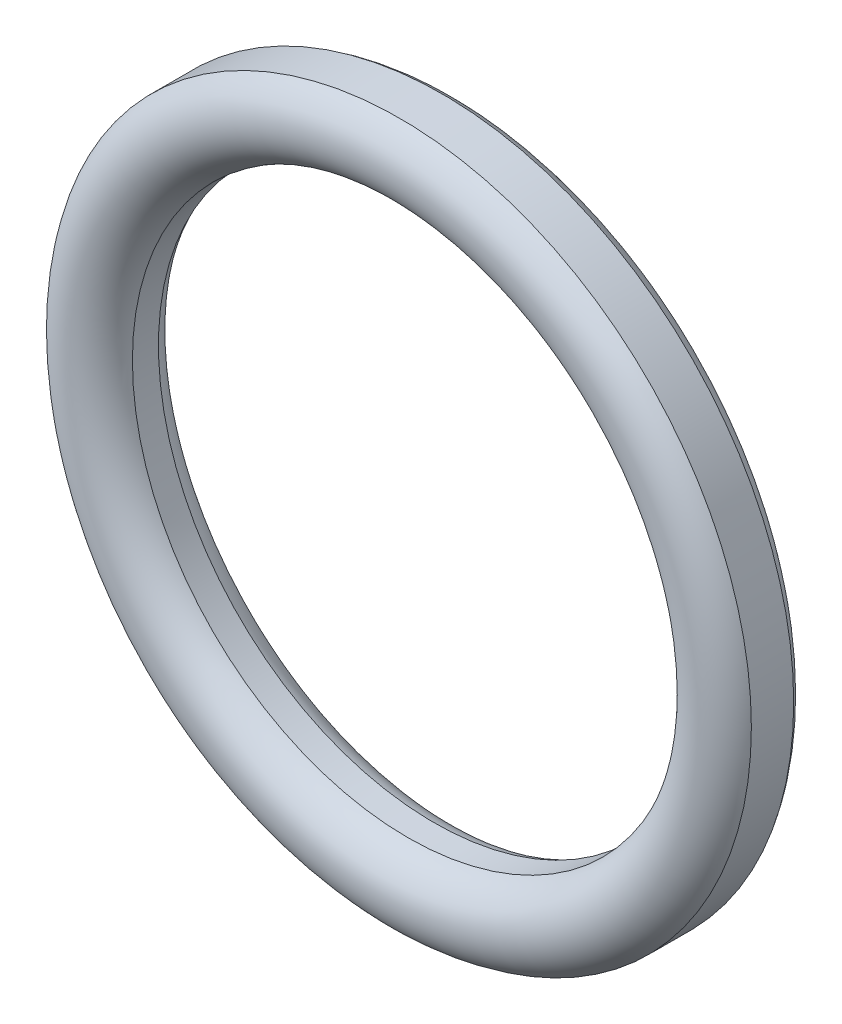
ISO-10303-21;
HEADER;
FILE_DESCRIPTION(('STEP AP214'),'2;1');
FILE_NAME('part.step','',(''),(''),'','','');
FILE_SCHEMA(('AUTOMOTIVE_DESIGN { 1 0 10303 214 1 1 1 1 }'));
ENDSEC;
DATA;
#1=APPLICATION_CONTEXT('core data for automotive mechanical design processes');
#2=APPLICATION_PROTOCOL_DEFINITION('international standard','automotive_design',2000,#1);
#3=PRODUCT_CONTEXT('',#1,'mechanical');
#4=PRODUCT('Part','Part','',(#3));
#5=PRODUCT_RELATED_PRODUCT_CATEGORY('part','',(#4));
#6=PRODUCT_DEFINITION_FORMATION('','',#4);
#7=PRODUCT_DEFINITION_CONTEXT('part definition',#1,'design');
#8=PRODUCT_DEFINITION('design','',#6,#7);
#9=PRODUCT_DEFINITION_SHAPE('','',#8);
#10=(LENGTH_UNIT() NAMED_UNIT(*) SI_UNIT(.MILLI.,.METRE.));
#11=(NAMED_UNIT(*) PLANE_ANGLE_UNIT() SI_UNIT($,.RADIAN.));
#12=(NAMED_UNIT(*) SI_UNIT($,.STERADIAN.) SOLID_ANGLE_UNIT());
#13=UNCERTAINTY_MEASURE_WITH_UNIT(LENGTH_MEASURE(1.E-05),#10,'distance_accuracy_value','');
#14=(GEOMETRIC_REPRESENTATION_CONTEXT(3) GLOBAL_UNCERTAINTY_ASSIGNED_CONTEXT((#13)) GLOBAL_UNIT_ASSIGNED_CONTEXT((#10,
#11,#12)) REPRESENTATION_CONTEXT('',''));
#15=CARTESIAN_POINT('',(0.,0.,0.));
#16=DIRECTION('',(0.,0.,1.));
#17=DIRECTION('',(1.,0.,0.));
#18=AXIS2_PLACEMENT_3D('',#15,#16,#17);
#19=CARTESIAN_POINT('',(0.,0.,0.));
#20=DIRECTION('',(0.,0.,-1.));
#21=DIRECTION('',(-1.,0.,0.));
#22=AXIS2_PLACEMENT_3D('',#19,#20,#21);
#23=TOROIDAL_SURFACE('',#22,9.87,1.31);
#24=CARTESIAN_POINT('',(0.,0.,-0.407523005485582));
#25=DIRECTION('',(0.,0.,1.));
#26=DIRECTION('',(1.,0.,0.));
#27=AXIS2_PLACEMENT_3D('',#24,#25,#26);
#28=CIRCLE('',#27,8.625);
#29=CARTESIAN_POINT('',(8.625,0.,-0.407523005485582));
#30=VERTEX_POINT('',#29);
#31=EDGE_CURVE('E11',#30,#30,#28,.F.);
#32=ORIENTED_EDGE('',*,*,#31,.F.);
#33=EDGE_LOOP('',(#32));
#34=FACE_BOUND('',#33,.T.);
#35=CARTESIAN_POINT('',(0.,0.,-0.662721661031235));
#36=DIRECTION('',(0.,0.,1.));
#37=DIRECTION('',(1.,0.,0.));
#38=AXIS2_PLACEMENT_3D('',#35,#36,#37);
#39=CIRCLE('',#38,11.);
#40=CARTESIAN_POINT('',(11.,0.,-0.662721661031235));
#41=VERTEX_POINT('',#40);
#42=EDGE_CURVE('E36',#41,#41,#39,.F.);
#43=ORIENTED_EDGE('',*,*,#42,.T.);
#44=EDGE_LOOP('',(#43));
#45=FACE_BOUND('',#44,.T.);
#46=ADVANCED_FACE('F33',(#34,#45),#23,.T.);
#47=CARTESIAN_POINT('',(0.,0.,0.407523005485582));
#48=DIRECTION('',(0.,0.,-1.));
#49=DIRECTION('',(-1.,0.,0.));
#50=AXIS2_PLACEMENT_3D('',#47,#48,#49);
#51=CIRCLE('',#50,8.625);
#52=CARTESIAN_POINT('',(-8.625,0.,0.407523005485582));
#53=VERTEX_POINT('',#52);
#54=EDGE_CURVE('E40',#53,#53,#51,.F.);
#55=ORIENTED_EDGE('',*,*,#54,.F.);
#56=EDGE_LOOP('',(#55));
#57=FACE_BOUND('',#56,.T.);
#58=CARTESIAN_POINT('',(0.,0.,0.662721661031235));
#59=DIRECTION('',(0.,0.,-1.));
#60=DIRECTION('',(-1.,0.,0.));
#61=AXIS2_PLACEMENT_3D('',#58,#59,#60);
#62=CIRCLE('',#61,11.);
#63=CARTESIAN_POINT('',(-11.,0.,0.662721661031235));
#64=VERTEX_POINT('',#63);
#65=EDGE_CURVE('E46',#64,#64,#62,.F.);
#66=ORIENTED_EDGE('',*,*,#65,.T.);
#67=EDGE_LOOP('',(#66));
#68=FACE_BOUND('',#67,.T.);
#69=ADVANCED_FACE('F62',(#57,#68),#23,.T.);
#70=CARTESIAN_POINT('',(0.,0.,-1.31));
#71=DIRECTION('',(0.,0.,1.));
#72=DIRECTION('',(1.,0.,0.));
#73=AXIS2_PLACEMENT_3D('',#70,#71,#72);
#74=CYLINDRICAL_SURFACE('',#73,8.625);
#75=ORIENTED_EDGE('',*,*,#31,.T.);
#76=EDGE_LOOP('',(#75));
#77=FACE_BOUND('',#76,.T.);
#78=ORIENTED_EDGE('',*,*,#54,.T.);
#79=EDGE_LOOP('',(#78));
#80=FACE_BOUND('',#79,.T.);
#81=ADVANCED_FACE('F57',(#77,#80),#74,.F.);
#82=CARTESIAN_POINT('',(0.,0.,-1.31));
#83=DIRECTION('',(0.,0.,1.));
#84=DIRECTION('',(1.,0.,0.));
#85=AXIS2_PLACEMENT_3D('',#82,#83,#84);
#86=CYLINDRICAL_SURFACE('',#85,11.);
#87=ORIENTED_EDGE('',*,*,#42,.F.);
#88=EDGE_LOOP('',(#87));
#89=FACE_BOUND('',#88,.T.);
#90=ORIENTED_EDGE('',*,*,#65,.F.);
#91=EDGE_LOOP('',(#90));
#92=FACE_BOUND('',#91,.T.);
#93=ADVANCED_FACE('F54',(#89,#92),#86,.T.);
#94=CLOSED_SHELL('',(#46,#69,#81,#93));
#95=MANIFOLD_SOLID_BREP('B2',#94);
#96=ADVANCED_BREP_SHAPE_REPRESENTATION('',(#18,#95),#14);
#97=SHAPE_DEFINITION_REPRESENTATION(#9,#96);
ENDSEC;
END-ISO-10303-21;
